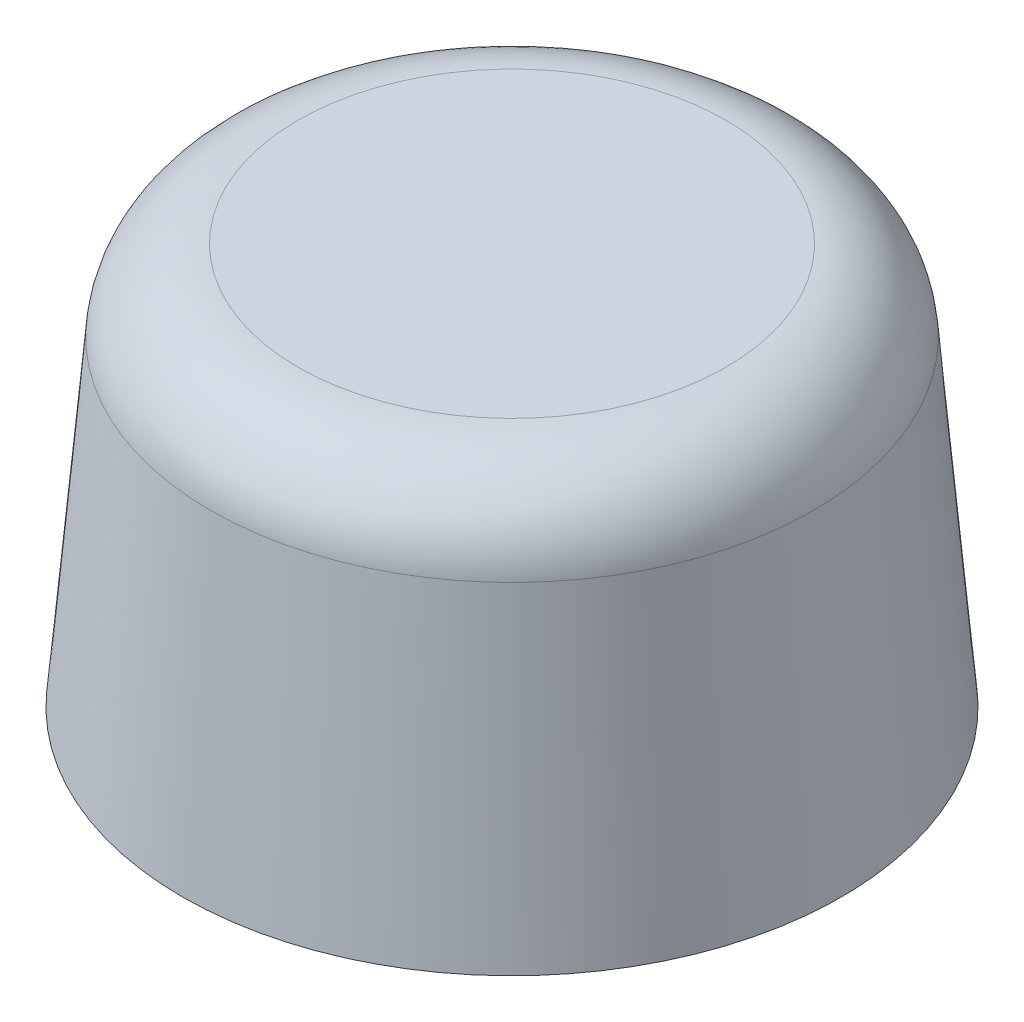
from build123d import *

# Parameters (mm, degrees)
SKETCH1_R           = 38.1
BOSS_EXTRUDE1_DEPTH = 46.355
BOSS_EXTRUDE1_TAPER = 5
FILLET1_R           = 10.16


with BuildPart() as part:
    # Sketch1 → Boss-Extrude1 (new body)
    with BuildSketch(Plane(origin=(0, 0, 0), x_dir=(1, 0, 0), z_dir=(0, 1, 0))):
        Circle(SKETCH1_R)
    extrude(amount=BOSS_EXTRUDE1_DEPTH, taper=BOSS_EXTRUDE1_TAPER)

    # Fillet1
    fillet1_edges = [part.edges().sort_by_distance(p)[0] for p in [
        (-34.044463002, 46.355, 0),
    ]]
    fillet(fillet1_edges, radius=FILLET1_R)


solid = part.part
